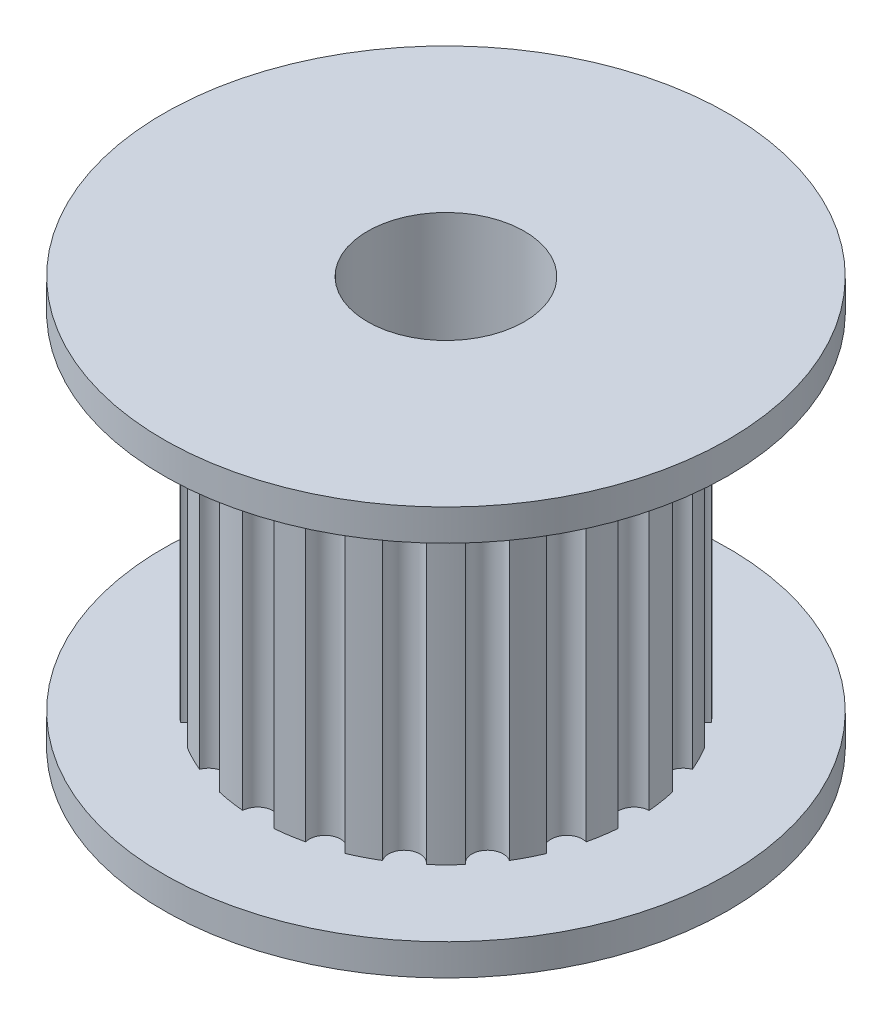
ISO-10303-21;
HEADER;
FILE_DESCRIPTION(('STEP AP214'),'2;1');
FILE_NAME('part.step','',(''),(''),'','','');
FILE_SCHEMA(('AUTOMOTIVE_DESIGN { 1 0 10303 214 1 1 1 1 }'));
ENDSEC;
DATA;
#1=APPLICATION_CONTEXT('core data for automotive mechanical design processes');
#2=APPLICATION_PROTOCOL_DEFINITION('international standard','automotive_design',2000,#1);
#3=PRODUCT_CONTEXT('',#1,'mechanical');
#4=PRODUCT('Part','Part','',(#3));
#5=PRODUCT_RELATED_PRODUCT_CATEGORY('part','',(#4));
#6=PRODUCT_DEFINITION_FORMATION('','',#4);
#7=PRODUCT_DEFINITION_CONTEXT('part definition',#1,'design');
#8=PRODUCT_DEFINITION('design','',#6,#7);
#9=PRODUCT_DEFINITION_SHAPE('','',#8);
#10=(LENGTH_UNIT() NAMED_UNIT(*) SI_UNIT(.MILLI.,.METRE.));
#11=(NAMED_UNIT(*) PLANE_ANGLE_UNIT() SI_UNIT($,.RADIAN.));
#12=(NAMED_UNIT(*) SI_UNIT($,.STERADIAN.) SOLID_ANGLE_UNIT());
#13=UNCERTAINTY_MEASURE_WITH_UNIT(LENGTH_MEASURE(1.E-05),#10,'distance_accuracy_value','');
#14=(GEOMETRIC_REPRESENTATION_CONTEXT(3) GLOBAL_UNCERTAINTY_ASSIGNED_CONTEXT((#13)) GLOBAL_UNIT_ASSIGNED_CONTEXT((#10,
#11,#12)) REPRESENTATION_CONTEXT('',''));
#15=CARTESIAN_POINT('',(0.,0.,0.));
#16=DIRECTION('',(0.,0.,1.));
#17=DIRECTION('',(1.,0.,0.));
#18=AXIS2_PLACEMENT_3D('',#15,#16,#17);
#19=CARTESIAN_POINT('',(0.,-6.5,0.));
#20=DIRECTION('',(0.,-1.,0.));
#21=DIRECTION('',(1.,0.,0.));
#22=AXIS2_PLACEMENT_3D('',#19,#20,#21);
#23=CYLINDRICAL_SURFACE('',#22,6.);
#24=CARTESIAN_POINT('',(0.,-5.5,0.));
#25=DIRECTION('',(0.,-1.,0.));
#26=DIRECTION('',(1.,0.,0.));
#27=AXIS2_PLACEMENT_3D('',#24,#25,#26);
#28=CIRCLE('',#27,6.);
#29=CARTESIAN_POINT('',(3.91862319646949,-5.5,-4.54361004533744));
#30=VERTEX_POINT('',#29);
#31=CARTESIAN_POINT('',(4.54361004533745,-5.5,-3.91862319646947));
#32=VERTEX_POINT('',#31);
#33=EDGE_CURVE('E1229',#30,#32,#28,.T.);
#34=ORIENTED_EDGE('',*,*,#33,.F.);
#35=DIRECTION('',(0.,-1.,0.));
#36=VECTOR('',#35,1.);
#37=CARTESIAN_POINT('',(3.91862319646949,6.6827502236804,-4.54361004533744));
#38=LINE('',#37,#36);
#39=CARTESIAN_POINT('',(3.91862319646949,5.5,-4.54361004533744));
#40=VERTEX_POINT('',#39);
#41=EDGE_CURVE('E669',#40,#30,#38,.T.);
#42=ORIENTED_EDGE('',*,*,#41,.F.);
#43=CARTESIAN_POINT('',(0.,5.5,0.));
#44=DIRECTION('',(0.,-1.,0.));
#45=DIRECTION('',(1.,0.,0.));
#46=AXIS2_PLACEMENT_3D('',#43,#44,#45);
#47=CIRCLE('',#46,6.);
#48=CARTESIAN_POINT('',(4.54361004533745,5.5,-3.91862319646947));
#49=VERTEX_POINT('',#48);
#50=EDGE_CURVE('E501',#40,#49,#47,.T.);
#51=ORIENTED_EDGE('',*,*,#50,.T.);
#52=DIRECTION('',(0.,-1.,0.));
#53=VECTOR('',#52,1.);
#54=CARTESIAN_POINT('',(4.54361004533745,6.6827502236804,-3.91862319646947));
#55=LINE('',#54,#53);
#56=EDGE_CURVE('E661',#49,#32,#55,.T.);
#57=ORIENTED_EDGE('',*,*,#56,.T.);
#58=EDGE_LOOP('',(#34,#42,#51,#57));
#59=FACE_BOUND('',#58,.T.);
#60=ADVANCED_FACE('F34',(#59),#23,.T.);
#61=CARTESIAN_POINT('',(2.32277940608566,5.5,-5.53215110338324));
#62=VERTEX_POINT('',#61);
#63=CARTESIAN_POINT('',(3.11030877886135,5.5,-5.13088484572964));
#64=VERTEX_POINT('',#63);
#65=EDGE_CURVE('E329',#62,#64,#47,.T.);
#66=ORIENTED_EDGE('',*,*,#65,.T.);
#67=DIRECTION('',(0.,-1.,0.));
#68=VECTOR('',#67,1.);
#69=CARTESIAN_POINT('',(3.11030877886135,6.6827502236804,-5.13088484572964));
#70=LINE('',#69,#68);
#71=CARTESIAN_POINT('',(3.11030877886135,-5.5,-5.13088484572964));
#72=VERTEX_POINT('',#71);
#73=EDGE_CURVE('E512',#64,#72,#70,.T.);
#74=ORIENTED_EDGE('',*,*,#73,.T.);
#75=CARTESIAN_POINT('',(2.32277940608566,-5.5,-5.53215110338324));
#76=VERTEX_POINT('',#75);
#77=EDGE_CURVE('E322',#76,#72,#28,.T.);
#78=ORIENTED_EDGE('',*,*,#77,.F.);
#79=DIRECTION('',(0.,-1.,0.));
#80=VECTOR('',#79,1.);
#81=CARTESIAN_POINT('',(2.32277940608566,6.6580169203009,-5.53215110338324));
#82=LINE('',#81,#80);
#83=EDGE_CURVE('E394',#62,#76,#82,.T.);
#84=ORIENTED_EDGE('',*,*,#83,.F.);
#85=EDGE_LOOP('',(#66,#74,#78,#84));
#86=FACE_BOUND('',#85,.T.);
#87=ADVANCED_FACE('F352',(#86),#23,.T.);
#88=CARTESIAN_POINT('',(5.13088484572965,-5.5,-3.11030877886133));
#89=VERTEX_POINT('',#88);
#90=CARTESIAN_POINT('',(5.53215110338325,-5.5,-2.32277940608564));
#91=VERTEX_POINT('',#90);
#92=EDGE_CURVE('E1226',#89,#91,#28,.T.);
#93=ORIENTED_EDGE('',*,*,#92,.F.);
#94=DIRECTION('',(0.,-1.,0.));
#95=VECTOR('',#94,1.);
#96=CARTESIAN_POINT('',(5.13088484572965,6.6827502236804,-3.11030877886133));
#97=LINE('',#96,#95);
#98=CARTESIAN_POINT('',(5.13088484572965,5.5,-3.11030877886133));
#99=VERTEX_POINT('',#98);
#100=EDGE_CURVE('E663',#99,#89,#97,.T.);
#101=ORIENTED_EDGE('',*,*,#100,.F.);
#102=CARTESIAN_POINT('',(5.53215110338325,5.5,-2.32277940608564));
#103=VERTEX_POINT('',#102);
#104=EDGE_CURVE('E495',#99,#103,#47,.T.);
#105=ORIENTED_EDGE('',*,*,#104,.T.);
#106=DIRECTION('',(0.,-1.,0.));
#107=VECTOR('',#106,1.);
#108=CARTESIAN_POINT('',(5.53215110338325,6.6580169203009,-2.32277940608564));
#109=LINE('',#108,#107);
#110=EDGE_CURVE('E651',#103,#91,#109,.T.);
#111=ORIENTED_EDGE('',*,*,#110,.T.);
#112=EDGE_LOOP('',(#93,#101,#105,#111));
#113=FACE_BOUND('',#112,.T.);
#114=ADVANCED_FACE('F358',(#113),#23,.T.);
#115=CARTESIAN_POINT('',(5.84089973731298,-5.5,-1.37254881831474));
#116=VERTEX_POINT('',#115);
#117=CARTESIAN_POINT('',(5.97916666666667,-5.5,-0.499565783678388));
#118=VERTEX_POINT('',#117);
#119=EDGE_CURVE('E1223',#116,#118,#28,.T.);
#120=ORIENTED_EDGE('',*,*,#119,.F.);
#121=DIRECTION('',(0.,-1.,0.));
#122=VECTOR('',#121,1.);
#123=CARTESIAN_POINT('',(5.84089973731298,6.6580169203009,-1.37254881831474));
#124=LINE('',#123,#122);
#125=CARTESIAN_POINT('',(5.84089973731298,5.5,-1.37254881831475));
#126=VERTEX_POINT('',#125);
#127=EDGE_CURVE('E653',#126,#116,#124,.T.);
#128=ORIENTED_EDGE('',*,*,#127,.F.);
#129=CARTESIAN_POINT('',(5.97916666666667,5.5,-0.499565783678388));
#130=VERTEX_POINT('',#129);
#131=EDGE_CURVE('E489',#126,#130,#47,.T.);
#132=ORIENTED_EDGE('',*,*,#131,.T.);
#133=DIRECTION('',(0.,-1.,0.));
#134=VECTOR('',#133,1.);
#135=CARTESIAN_POINT('',(5.97916666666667,6.61725730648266,-0.499565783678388));
#136=LINE('',#135,#134);
#137=EDGE_CURVE('E641',#130,#118,#136,.T.);
#138=ORIENTED_EDGE('',*,*,#137,.T.);
#139=EDGE_LOOP('',(#120,#128,#132,#138));
#140=FACE_BOUND('',#139,.T.);
#141=ADVANCED_FACE('F836',(#140),#23,.T.);
#142=CARTESIAN_POINT('',(5.97916666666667,-5.5,0.49956578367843));
#143=VERTEX_POINT('',#142);
#144=CARTESIAN_POINT('',(5.84089973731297,-5.5,1.37254881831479));
#145=VERTEX_POINT('',#144);
#146=EDGE_CURVE('E1220',#143,#145,#28,.T.);
#147=ORIENTED_EDGE('',*,*,#146,.F.);
#148=DIRECTION('',(0.,-1.,0.));
#149=VECTOR('',#148,1.);
#150=CARTESIAN_POINT('',(5.97916666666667,6.61725730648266,0.49956578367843));
#151=LINE('',#150,#149);
#152=CARTESIAN_POINT('',(5.97916666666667,5.5,0.49956578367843));
#153=VERTEX_POINT('',#152);
#154=EDGE_CURVE('E643',#153,#143,#151,.T.);
#155=ORIENTED_EDGE('',*,*,#154,.F.);
#156=CARTESIAN_POINT('',(5.84089973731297,5.5,1.37254881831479));
#157=VERTEX_POINT('',#156);
#158=EDGE_CURVE('E483',#153,#157,#47,.T.);
#159=ORIENTED_EDGE('',*,*,#158,.T.);
#160=DIRECTION('',(0.,-1.,0.));
#161=VECTOR('',#160,1.);
#162=CARTESIAN_POINT('',(5.84089973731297,6.6580169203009,1.37254881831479));
#163=LINE('',#162,#161);
#164=EDGE_CURVE('E631',#157,#145,#163,.T.);
#165=ORIENTED_EDGE('',*,*,#164,.T.);
#166=EDGE_LOOP('',(#147,#155,#159,#165));
#167=FACE_BOUND('',#166,.T.);
#168=ADVANCED_FACE('F844',(#167),#23,.T.);
#169=CARTESIAN_POINT('',(5.53215110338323,-5.5,2.32277940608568));
#170=VERTEX_POINT('',#169);
#171=CARTESIAN_POINT('',(5.13088484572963,-5.5,3.11030877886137));
#172=VERTEX_POINT('',#171);
#173=EDGE_CURVE('E1217',#170,#172,#28,.T.);
#174=ORIENTED_EDGE('',*,*,#173,.F.);
#175=DIRECTION('',(0.,-1.,0.));
#176=VECTOR('',#175,1.);
#177=CARTESIAN_POINT('',(5.53215110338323,6.6580169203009,2.32277940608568));
#178=LINE('',#177,#176);
#179=CARTESIAN_POINT('',(5.53215110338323,5.5,2.32277940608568));
#180=VERTEX_POINT('',#179);
#181=EDGE_CURVE('E633',#180,#170,#178,.T.);
#182=ORIENTED_EDGE('',*,*,#181,.F.);
#183=CARTESIAN_POINT('',(5.13088484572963,5.5,3.11030877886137));
#184=VERTEX_POINT('',#183);
#185=EDGE_CURVE('E477',#180,#184,#47,.T.);
#186=ORIENTED_EDGE('',*,*,#185,.T.);
#187=DIRECTION('',(0.,-1.,0.));
#188=VECTOR('',#187,1.);
#189=CARTESIAN_POINT('',(5.13088484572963,6.6827502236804,3.11030877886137));
#190=LINE('',#189,#188);
#191=EDGE_CURVE('E621',#184,#172,#190,.T.);
#192=ORIENTED_EDGE('',*,*,#191,.T.);
#193=EDGE_LOOP('',(#174,#182,#186,#192));
#194=FACE_BOUND('',#193,.T.);
#195=ADVANCED_FACE('F852',(#194),#23,.T.);
#196=CARTESIAN_POINT('',(4.54361004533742,-5.5,3.91862319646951));
#197=VERTEX_POINT('',#196);
#198=CARTESIAN_POINT('',(3.91862319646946,-5.5,4.54361004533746));
#199=VERTEX_POINT('',#198);
#200=EDGE_CURVE('E1214',#197,#199,#28,.T.);
#201=ORIENTED_EDGE('',*,*,#200,.F.);
#202=DIRECTION('',(0.,-1.,0.));
#203=VECTOR('',#202,1.);
#204=CARTESIAN_POINT('',(4.54361004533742,6.6827502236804,3.91862319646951));
#205=LINE('',#204,#203);
#206=CARTESIAN_POINT('',(4.54361004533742,5.5,3.91862319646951));
#207=VERTEX_POINT('',#206);
#208=EDGE_CURVE('E623',#207,#197,#205,.T.);
#209=ORIENTED_EDGE('',*,*,#208,.F.);
#210=CARTESIAN_POINT('',(3.91862319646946,5.5,4.54361004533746));
#211=VERTEX_POINT('',#210);
#212=EDGE_CURVE('E471',#207,#211,#47,.T.);
#213=ORIENTED_EDGE('',*,*,#212,.T.);
#214=DIRECTION('',(0.,-1.,0.));
#215=VECTOR('',#214,1.);
#216=CARTESIAN_POINT('',(3.91862319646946,6.6827502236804,4.54361004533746));
#217=LINE('',#216,#215);
#218=EDGE_CURVE('E611',#211,#199,#217,.T.);
#219=ORIENTED_EDGE('',*,*,#218,.T.);
#220=EDGE_LOOP('',(#201,#209,#213,#219));
#221=FACE_BOUND('',#220,.T.);
#222=ADVANCED_FACE('F860',(#221),#23,.T.);
#223=CARTESIAN_POINT('',(3.11030877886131,-5.5,5.13088484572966));
#224=VERTEX_POINT('',#223);
#225=CARTESIAN_POINT('',(2.32277940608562,-5.5,5.53215110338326));
#226=VERTEX_POINT('',#225);
#227=EDGE_CURVE('E1211',#224,#226,#28,.T.);
#228=ORIENTED_EDGE('',*,*,#227,.F.);
#229=DIRECTION('',(0.,-1.,0.));
#230=VECTOR('',#229,1.);
#231=CARTESIAN_POINT('',(3.11030877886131,6.6827502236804,5.13088484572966));
#232=LINE('',#231,#230);
#233=CARTESIAN_POINT('',(3.11030877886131,5.5,5.13088484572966));
#234=VERTEX_POINT('',#233);
#235=EDGE_CURVE('E613',#234,#224,#232,.T.);
#236=ORIENTED_EDGE('',*,*,#235,.F.);
#237=CARTESIAN_POINT('',(2.32277940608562,5.5,5.53215110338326));
#238=VERTEX_POINT('',#237);
#239=EDGE_CURVE('E465',#234,#238,#47,.T.);
#240=ORIENTED_EDGE('',*,*,#239,.T.);
#241=DIRECTION('',(0.,-1.,0.));
#242=VECTOR('',#241,1.);
#243=CARTESIAN_POINT('',(2.32277940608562,6.6580169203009,5.53215110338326));
#244=LINE('',#243,#242);
#245=EDGE_CURVE('E601',#238,#226,#244,.T.);
#246=ORIENTED_EDGE('',*,*,#245,.T.);
#247=EDGE_LOOP('',(#228,#236,#240,#246));
#248=FACE_BOUND('',#247,.T.);
#249=ADVANCED_FACE('F868',(#248),#23,.T.);
#250=CARTESIAN_POINT('',(1.37254881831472,-5.5,5.84089973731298));
#251=VERTEX_POINT('',#250);
#252=CARTESIAN_POINT('',(0.49956578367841,-5.5,5.97916666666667));
#253=VERTEX_POINT('',#252);
#254=EDGE_CURVE('E1208',#251,#253,#28,.T.);
#255=ORIENTED_EDGE('',*,*,#254,.F.);
#256=DIRECTION('',(0.,-1.,0.));
#257=VECTOR('',#256,1.);
#258=CARTESIAN_POINT('',(1.37254881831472,6.6580169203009,5.84089973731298));
#259=LINE('',#258,#257);
#260=CARTESIAN_POINT('',(1.37254881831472,5.5,5.84089973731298));
#261=VERTEX_POINT('',#260);
#262=EDGE_CURVE('E603',#261,#251,#259,.T.);
#263=ORIENTED_EDGE('',*,*,#262,.F.);
#264=CARTESIAN_POINT('',(0.499565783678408,5.5,5.97916666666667));
#265=VERTEX_POINT('',#264);
#266=EDGE_CURVE('E459',#261,#265,#47,.T.);
#267=ORIENTED_EDGE('',*,*,#266,.T.);
#268=DIRECTION('',(0.,-1.,0.));
#269=VECTOR('',#268,1.);
#270=CARTESIAN_POINT('',(0.499565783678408,6.61725730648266,5.97916666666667));
#271=LINE('',#270,#269);
#272=EDGE_CURVE('E591',#265,#253,#271,.T.);
#273=ORIENTED_EDGE('',*,*,#272,.T.);
#274=EDGE_LOOP('',(#255,#263,#267,#273));
#275=FACE_BOUND('',#274,.T.);
#276=ADVANCED_FACE('F876',(#275),#23,.T.);
#277=CARTESIAN_POINT('',(-0.499565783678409,-5.5,5.97916666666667));
#278=VERTEX_POINT('',#277);
#279=CARTESIAN_POINT('',(-1.37254881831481,-5.5,5.84089973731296));
#280=VERTEX_POINT('',#279);
#281=EDGE_CURVE('E1205',#278,#280,#28,.T.);
#282=ORIENTED_EDGE('',*,*,#281,.F.);
#283=DIRECTION('',(0.,-1.,0.));
#284=VECTOR('',#283,1.);
#285=CARTESIAN_POINT('',(-0.49956578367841,6.61725730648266,5.97916666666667));
#286=LINE('',#285,#284);
#287=CARTESIAN_POINT('',(-0.49956578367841,5.5,5.97916666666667));
#288=VERTEX_POINT('',#287);
#289=EDGE_CURVE('E593',#288,#278,#286,.T.);
#290=ORIENTED_EDGE('',*,*,#289,.F.);
#291=CARTESIAN_POINT('',(-1.37254881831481,5.5,5.84089973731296));
#292=VERTEX_POINT('',#291);
#293=EDGE_CURVE('E453',#288,#292,#47,.T.);
#294=ORIENTED_EDGE('',*,*,#293,.T.);
#295=DIRECTION('',(0.,-1.,0.));
#296=VECTOR('',#295,1.);
#297=CARTESIAN_POINT('',(-1.37254881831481,6.6580169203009,5.84089973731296));
#298=LINE('',#297,#296);
#299=EDGE_CURVE('E581',#292,#280,#298,.T.);
#300=ORIENTED_EDGE('',*,*,#299,.T.);
#301=EDGE_LOOP('',(#282,#290,#294,#300));
#302=FACE_BOUND('',#301,.T.);
#303=ADVANCED_FACE('F884',(#302),#23,.T.);
#304=CARTESIAN_POINT('',(-2.3227794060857,-5.5,5.53215110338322));
#305=VERTEX_POINT('',#304);
#306=CARTESIAN_POINT('',(-3.11030877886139,-5.5,5.13088484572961));
#307=VERTEX_POINT('',#306);
#308=EDGE_CURVE('E1202',#305,#307,#28,.T.);
#309=ORIENTED_EDGE('',*,*,#308,.F.);
#310=DIRECTION('',(0.,-1.,0.));
#311=VECTOR('',#310,1.);
#312=CARTESIAN_POINT('',(-2.3227794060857,6.6580169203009,5.53215110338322));
#313=LINE('',#312,#311);
#314=CARTESIAN_POINT('',(-2.3227794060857,5.5,5.53215110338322));
#315=VERTEX_POINT('',#314);
#316=EDGE_CURVE('E583',#315,#305,#313,.T.);
#317=ORIENTED_EDGE('',*,*,#316,.F.);
#318=CARTESIAN_POINT('',(-3.11030877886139,5.5,5.13088484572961));
#319=VERTEX_POINT('',#318);
#320=EDGE_CURVE('E447',#315,#319,#47,.T.);
#321=ORIENTED_EDGE('',*,*,#320,.T.);
#322=DIRECTION('',(0.,-1.,0.));
#323=VECTOR('',#322,1.);
#324=CARTESIAN_POINT('',(-3.11030877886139,6.6827502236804,5.13088484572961));
#325=LINE('',#324,#323);
#326=EDGE_CURVE('E571',#319,#307,#325,.T.);
#327=ORIENTED_EDGE('',*,*,#326,.T.);
#328=EDGE_LOOP('',(#309,#317,#321,#327));
#329=FACE_BOUND('',#328,.T.);
#330=ADVANCED_FACE('F892',(#329),#23,.T.);
#331=CARTESIAN_POINT('',(-3.91862319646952,-5.5,4.54361004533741));
#332=VERTEX_POINT('',#331);
#333=CARTESIAN_POINT('',(-4.54361004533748,-5.5,3.91862319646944));
#334=VERTEX_POINT('',#333);
#335=EDGE_CURVE('E1199',#332,#334,#28,.T.);
#336=ORIENTED_EDGE('',*,*,#335,.F.);
#337=DIRECTION('',(0.,-1.,0.));
#338=VECTOR('',#337,1.);
#339=CARTESIAN_POINT('',(-3.91862319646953,6.6827502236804,4.54361004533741));
#340=LINE('',#339,#338);
#341=CARTESIAN_POINT('',(-3.91862319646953,5.5,4.54361004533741));
#342=VERTEX_POINT('',#341);
#343=EDGE_CURVE('E573',#342,#332,#340,.T.);
#344=ORIENTED_EDGE('',*,*,#343,.F.);
#345=CARTESIAN_POINT('',(-4.54361004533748,5.5,3.91862319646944));
#346=VERTEX_POINT('',#345);
#347=EDGE_CURVE('E441',#342,#346,#47,.T.);
#348=ORIENTED_EDGE('',*,*,#347,.T.);
#349=DIRECTION('',(0.,-1.,0.));
#350=VECTOR('',#349,1.);
#351=CARTESIAN_POINT('',(-4.54361004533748,6.6827502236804,3.91862319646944));
#352=LINE('',#351,#350);
#353=EDGE_CURVE('E561',#346,#334,#352,.T.);
#354=ORIENTED_EDGE('',*,*,#353,.T.);
#355=EDGE_LOOP('',(#336,#344,#348,#354));
#356=FACE_BOUND('',#355,.T.);
#357=ADVANCED_FACE('F900',(#356),#23,.T.);
#358=CARTESIAN_POINT('',(-5.13088484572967,-5.5,3.11030877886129));
#359=VERTEX_POINT('',#358);
#360=CARTESIAN_POINT('',(-5.53215110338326,-5.5,2.3227794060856));
#361=VERTEX_POINT('',#360);
#362=EDGE_CURVE('E1196',#359,#361,#28,.T.);
#363=ORIENTED_EDGE('',*,*,#362,.F.);
#364=DIRECTION('',(0.,-1.,0.));
#365=VECTOR('',#364,1.);
#366=CARTESIAN_POINT('',(-5.13088484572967,6.6827502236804,3.11030877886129));
#367=LINE('',#366,#365);
#368=CARTESIAN_POINT('',(-5.13088484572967,5.5,3.11030877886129));
#369=VERTEX_POINT('',#368);
#370=EDGE_CURVE('E563',#369,#359,#367,.T.);
#371=ORIENTED_EDGE('',*,*,#370,.F.);
#372=CARTESIAN_POINT('',(-5.53215110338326,5.5,2.3227794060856));
#373=VERTEX_POINT('',#372);
#374=EDGE_CURVE('E435',#369,#373,#47,.T.);
#375=ORIENTED_EDGE('',*,*,#374,.T.);
#376=DIRECTION('',(0.,-1.,0.));
#377=VECTOR('',#376,1.);
#378=CARTESIAN_POINT('',(-5.53215110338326,6.6580169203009,2.3227794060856));
#379=LINE('',#378,#377);
#380=EDGE_CURVE('E551',#373,#361,#379,.T.);
#381=ORIENTED_EDGE('',*,*,#380,.T.);
#382=EDGE_LOOP('',(#363,#371,#375,#381));
#383=FACE_BOUND('',#382,.T.);
#384=ADVANCED_FACE('F908',(#383),#23,.T.);
#385=CARTESIAN_POINT('',(-5.84089973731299,-5.5,1.3725488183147));
#386=VERTEX_POINT('',#385);
#387=CARTESIAN_POINT('',(-5.97916666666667,-5.5,0.499565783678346));
#388=VERTEX_POINT('',#387);
#389=EDGE_CURVE('E1194',#386,#388,#28,.T.);
#390=ORIENTED_EDGE('',*,*,#389,.F.);
#391=DIRECTION('',(0.,-1.,0.));
#392=VECTOR('',#391,1.);
#393=CARTESIAN_POINT('',(-5.84089973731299,6.6580169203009,1.3725488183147));
#394=LINE('',#393,#392);
#395=CARTESIAN_POINT('',(-5.84089973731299,5.5,1.3725488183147));
#396=VERTEX_POINT('',#395);
#397=EDGE_CURVE('E553',#396,#386,#394,.T.);
#398=ORIENTED_EDGE('',*,*,#397,.F.);
#399=CARTESIAN_POINT('',(-5.97916666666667,5.5,0.499565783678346));
#400=VERTEX_POINT('',#399);
#401=EDGE_CURVE('E429',#396,#400,#47,.T.);
#402=ORIENTED_EDGE('',*,*,#401,.T.);
#403=DIRECTION('',(0.,-1.,0.));
#404=VECTOR('',#403,1.);
#405=CARTESIAN_POINT('',(-5.97916666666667,6.61725730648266,0.499565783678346));
#406=LINE('',#405,#404);
#407=EDGE_CURVE('E541',#400,#388,#406,.T.);
#408=ORIENTED_EDGE('',*,*,#407,.T.);
#409=EDGE_LOOP('',(#390,#398,#402,#408));
#410=FACE_BOUND('',#409,.T.);
#411=ADVANCED_FACE('F916',(#410),#23,.T.);
#412=CARTESIAN_POINT('',(-5.97916666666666,-5.5,-0.499565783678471));
#413=VERTEX_POINT('',#412);
#414=CARTESIAN_POINT('',(-5.84089973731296,-5.5,-1.37254881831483));
#415=VERTEX_POINT('',#414);
#416=EDGE_CURVE('E316',#413,#415,#28,.T.);
#417=ORIENTED_EDGE('',*,*,#416,.F.);
#418=DIRECTION('',(0.,-1.,0.));
#419=VECTOR('',#418,1.);
#420=CARTESIAN_POINT('',(-5.97916666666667,6.61725730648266,-0.499565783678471));
#421=LINE('',#420,#419);
#422=CARTESIAN_POINT('',(-5.97916666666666,5.5,-0.499565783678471));
#423=VERTEX_POINT('',#422);
#424=EDGE_CURVE('E543',#423,#413,#421,.T.);
#425=ORIENTED_EDGE('',*,*,#424,.F.);
#426=CARTESIAN_POINT('',(-5.84089973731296,5.5,-1.37254881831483));
#427=VERTEX_POINT('',#426);
#428=EDGE_CURVE('E423',#423,#427,#47,.T.);
#429=ORIENTED_EDGE('',*,*,#428,.T.);
#430=DIRECTION('',(0.,-1.,0.));
#431=VECTOR('',#430,1.);
#432=CARTESIAN_POINT('',(-5.84089973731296,6.6580169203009,-1.37254881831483));
#433=LINE('',#432,#431);
#434=EDGE_CURVE('E531',#427,#415,#433,.T.);
#435=ORIENTED_EDGE('',*,*,#434,.T.);
#436=EDGE_LOOP('',(#417,#425,#429,#435));
#437=FACE_BOUND('',#436,.T.);
#438=ADVANCED_FACE('F924',(#437),#23,.T.);
#439=CARTESIAN_POINT('',(-5.53215110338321,-5.5,-2.32277940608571));
#440=VERTEX_POINT('',#439);
#441=CARTESIAN_POINT('',(-5.1308848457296,-5.5,-3.1103087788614));
#442=VERTEX_POINT('',#441);
#443=EDGE_CURVE('E313',#440,#442,#28,.T.);
#444=ORIENTED_EDGE('',*,*,#443,.F.);
#445=DIRECTION('',(0.,-1.,0.));
#446=VECTOR('',#445,1.);
#447=CARTESIAN_POINT('',(-5.53215110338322,6.6580169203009,-2.32277940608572));
#448=LINE('',#447,#446);
#449=CARTESIAN_POINT('',(-5.53215110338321,5.5,-2.32277940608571));
#450=VERTEX_POINT('',#449);
#451=EDGE_CURVE('E533',#450,#440,#448,.T.);
#452=ORIENTED_EDGE('',*,*,#451,.F.);
#453=CARTESIAN_POINT('',(-5.13088484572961,5.5,-3.1103087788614));
#454=VERTEX_POINT('',#453);
#455=EDGE_CURVE('E421',#450,#454,#47,.T.);
#456=ORIENTED_EDGE('',*,*,#455,.T.);
#457=DIRECTION('',(0.,-1.,0.));
#458=VECTOR('',#457,1.);
#459=CARTESIAN_POINT('',(-5.13088484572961,6.6827502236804,-3.1103087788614));
#460=LINE('',#459,#458);
#461=EDGE_CURVE('E522',#454,#442,#460,.T.);
#462=ORIENTED_EDGE('',*,*,#461,.T.);
#463=EDGE_LOOP('',(#444,#452,#456,#462));
#464=FACE_BOUND('',#463,.T.);
#465=ADVANCED_FACE('F932',(#464),#23,.T.);
#466=CARTESIAN_POINT('',(-4.54361004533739,-5.5,-3.91862319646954));
#467=VERTEX_POINT('',#466);
#468=CARTESIAN_POINT('',(-3.91862319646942,-5.5,-4.54361004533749));
#469=VERTEX_POINT('',#468);
#470=EDGE_CURVE('E302',#467,#469,#28,.T.);
#471=ORIENTED_EDGE('',*,*,#470,.F.);
#472=DIRECTION('',(0.,-1.,0.));
#473=VECTOR('',#472,1.);
#474=CARTESIAN_POINT('',(-4.54361004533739,6.6827502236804,-3.91862319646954));
#475=LINE('',#474,#473);
#476=CARTESIAN_POINT('',(-4.54361004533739,5.5,-3.91862319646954));
#477=VERTEX_POINT('',#476);
#478=EDGE_CURVE('E524',#477,#467,#475,.T.);
#479=ORIENTED_EDGE('',*,*,#478,.F.);
#480=CARTESIAN_POINT('',(-3.91862319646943,5.5,-4.54361004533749));
#481=VERTEX_POINT('',#480);
#482=EDGE_CURVE('E304',#477,#481,#47,.T.);
#483=ORIENTED_EDGE('',*,*,#482,.T.);
#484=DIRECTION('',(0.,-1.,0.));
#485=VECTOR('',#484,1.);
#486=CARTESIAN_POINT('',(-3.91862319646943,6.6827502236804,-4.54361004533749));
#487=LINE('',#486,#485);
#488=EDGE_CURVE('E290',#481,#469,#487,.T.);
#489=ORIENTED_EDGE('',*,*,#488,.T.);
#490=EDGE_LOOP('',(#471,#479,#483,#489));
#491=FACE_BOUND('',#490,.T.);
#492=ADVANCED_FACE('F300',(#491),#23,.T.);
#493=CARTESIAN_POINT('',(-3.11030877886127,-5.5,-5.13088484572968));
#494=VERTEX_POINT('',#493);
#495=CARTESIAN_POINT('',(-2.32277940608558,-5.5,-5.53215110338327));
#496=VERTEX_POINT('',#495);
#497=EDGE_CURVE('E314',#494,#496,#28,.T.);
#498=ORIENTED_EDGE('',*,*,#497,.F.);
#499=DIRECTION('',(0.,-1.,0.));
#500=VECTOR('',#499,1.);
#501=CARTESIAN_POINT('',(-3.11030877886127,6.6827502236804,-5.13088484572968));
#502=LINE('',#501,#500);
#503=CARTESIAN_POINT('',(-3.11030877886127,5.5,-5.13088484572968));
#504=VERTEX_POINT('',#503);
#505=EDGE_CURVE('E293',#504,#494,#502,.T.);
#506=ORIENTED_EDGE('',*,*,#505,.F.);
#507=CARTESIAN_POINT('',(-2.32277940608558,5.5,-5.53215110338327));
#508=VERTEX_POINT('',#507);
#509=EDGE_CURVE('E416',#504,#508,#47,.T.);
#510=ORIENTED_EDGE('',*,*,#509,.T.);
#511=DIRECTION('',(0.,-1.,0.));
#512=VECTOR('',#511,1.);
#513=CARTESIAN_POINT('',(-2.32277940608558,6.6580169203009,-5.53215110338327));
#514=LINE('',#513,#512);
#515=EDGE_CURVE('E674',#508,#496,#514,.T.);
#516=ORIENTED_EDGE('',*,*,#515,.T.);
#517=EDGE_LOOP('',(#498,#506,#510,#516));
#518=FACE_BOUND('',#517,.T.);
#519=ADVANCED_FACE('F369',(#518),#23,.T.);
#520=CARTESIAN_POINT('',(-1.37254881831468,-5.5,-5.84089973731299));
#521=VERTEX_POINT('',#520);
#522=CARTESIAN_POINT('',(-0.499565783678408,-5.5,-5.97916666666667));
#523=VERTEX_POINT('',#522);
#524=EDGE_CURVE('E317',#521,#523,#28,.T.);
#525=ORIENTED_EDGE('',*,*,#524,.F.);
#526=DIRECTION('',(0.,-1.,0.));
#527=VECTOR('',#526,1.);
#528=CARTESIAN_POINT('',(-1.37254881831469,6.6580169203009,-5.84089973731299));
#529=LINE('',#528,#527);
#530=CARTESIAN_POINT('',(-1.37254881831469,5.5,-5.84089973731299));
#531=VERTEX_POINT('',#530);
#532=EDGE_CURVE('E414',#531,#521,#529,.T.);
#533=ORIENTED_EDGE('',*,*,#532,.F.);
#534=CARTESIAN_POINT('',(-0.49956578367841,5.5,-5.97916666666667));
#535=VERTEX_POINT('',#534);
#536=EDGE_CURVE('E321',#531,#535,#47,.T.);
#537=ORIENTED_EDGE('',*,*,#536,.T.);
#538=DIRECTION('',(0.,-1.,0.));
#539=VECTOR('',#538,1.);
#540=CARTESIAN_POINT('',(-0.49956578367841,6.61725730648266,-5.97916666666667));
#541=LINE('',#540,#539);
#542=EDGE_CURVE('E399',#535,#523,#541,.T.);
#543=ORIENTED_EDGE('',*,*,#542,.T.);
#544=EDGE_LOOP('',(#525,#533,#537,#543));
#545=FACE_BOUND('',#544,.T.);
#546=ADVANCED_FACE('F364',(#545),#23,.T.);
#547=CARTESIAN_POINT('',(0.499565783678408,5.5,-5.97916666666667));
#548=VERTEX_POINT('',#547);
#549=CARTESIAN_POINT('',(1.37254881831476,5.5,-5.84089973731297));
#550=VERTEX_POINT('',#549);
#551=EDGE_CURVE('E325',#548,#550,#47,.T.);
#552=ORIENTED_EDGE('',*,*,#551,.T.);
#553=DIRECTION('',(0.,-1.,0.));
#554=VECTOR('',#553,1.);
#555=CARTESIAN_POINT('',(1.37254881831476,6.6580169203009,-5.84089973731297));
#556=LINE('',#555,#554);
#557=CARTESIAN_POINT('',(1.37254881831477,-5.5,-5.84089973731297));
#558=VERTEX_POINT('',#557);
#559=EDGE_CURVE('E375',#550,#558,#556,.T.);
#560=ORIENTED_EDGE('',*,*,#559,.T.);
#561=CARTESIAN_POINT('',(0.499565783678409,-5.5,-5.97916666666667));
#562=VERTEX_POINT('',#561);
#563=EDGE_CURVE('E318',#562,#558,#28,.T.);
#564=ORIENTED_EDGE('',*,*,#563,.F.);
#565=DIRECTION('',(0.,-1.,0.));
#566=VECTOR('',#565,1.);
#567=CARTESIAN_POINT('',(0.499565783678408,6.61725730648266,-5.97916666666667));
#568=LINE('',#567,#566);
#569=EDGE_CURVE('E377',#548,#562,#568,.T.);
#570=ORIENTED_EDGE('',*,*,#569,.F.);
#571=EDGE_LOOP('',(#552,#560,#564,#570));
#572=FACE_BOUND('',#571,.T.);
#573=ADVANCED_FACE('F349',(#572),#23,.T.);
#574=CARTESIAN_POINT('',(9.,-6.5,0.));
#575=DIRECTION('',(0.,-1.,0.));
#576=DIRECTION('',(1.,0.,0.));
#577=AXIS2_PLACEMENT_3D('',#574,#575,#576);
#578=PLANE('',#577);
#579=CARTESIAN_POINT('',(0.,-6.5,0.));
#580=DIRECTION('',(0.,-1.,0.));
#581=DIRECTION('',(1.,0.,0.));
#582=AXIS2_PLACEMENT_3D('',#579,#580,#581);
#583=CIRCLE('',#582,9.);
#584=CARTESIAN_POINT('',(9.,-6.5,0.));
#585=VERTEX_POINT('',#584);
#586=EDGE_CURVE('E402',#585,#585,#583,.T.);
#587=ORIENTED_EDGE('',*,*,#586,.T.);
#588=EDGE_LOOP('',(#587));
#589=FACE_BOUND('',#588,.T.);
#590=CARTESIAN_POINT('',(0.,-6.5,0.));
#591=DIRECTION('',(0.,-1.,0.));
#592=DIRECTION('',(1.,0.,0.));
#593=AXIS2_PLACEMENT_3D('',#590,#591,#592);
#594=CIRCLE('',#593,2.5);
#595=CARTESIAN_POINT('',(2.5,-6.5,0.));
#596=VERTEX_POINT('',#595);
#597=EDGE_CURVE('E11',#596,#596,#594,.T.);
#598=ORIENTED_EDGE('',*,*,#597,.F.);
#599=EDGE_LOOP('',(#598));
#600=FACE_BOUND('',#599,.T.);
#601=ADVANCED_FACE('F36',(#589,#600),#578,.T.);
#602=CARTESIAN_POINT('',(0.,-6.5,0.));
#603=DIRECTION('',(0.,-1.,0.));
#604=DIRECTION('',(1.,0.,0.));
#605=AXIS2_PLACEMENT_3D('',#602,#603,#604);
#606=CYLINDRICAL_SURFACE('',#605,2.5);
#607=ORIENTED_EDGE('',*,*,#597,.T.);
#608=EDGE_LOOP('',(#607));
#609=FACE_BOUND('',#608,.T.);
#610=CARTESIAN_POINT('',(0.,6.5,0.));
#611=DIRECTION('',(0.,-1.,0.));
#612=DIRECTION('',(1.,0.,0.));
#613=AXIS2_PLACEMENT_3D('',#610,#611,#612);
#614=CIRCLE('',#613,2.5);
#615=CARTESIAN_POINT('',(2.5,6.5,0.));
#616=VERTEX_POINT('',#615);
#617=EDGE_CURVE('E42',#616,#616,#614,.T.);
#618=ORIENTED_EDGE('',*,*,#617,.F.);
#619=EDGE_LOOP('',(#618));
#620=FACE_BOUND('',#619,.T.);
#621=ADVANCED_FACE('F340',(#609,#620),#606,.F.);
#622=CARTESIAN_POINT('',(2.5,6.5,0.));
#623=DIRECTION('',(0.,1.,0.));
#624=DIRECTION('',(-1.,0.,0.));
#625=AXIS2_PLACEMENT_3D('',#622,#623,#624);
#626=PLANE('',#625);
#627=ORIENTED_EDGE('',*,*,#617,.T.);
#628=EDGE_LOOP('',(#627));
#629=FACE_BOUND('',#628,.T.);
#630=CARTESIAN_POINT('',(0.,6.5,0.));
#631=DIRECTION('',(0.,-1.,0.));
#632=DIRECTION('',(1.,0.,0.));
#633=AXIS2_PLACEMENT_3D('',#630,#631,#632);
#634=CIRCLE('',#633,9.);
#635=CARTESIAN_POINT('',(9.,6.5,0.));
#636=VERTEX_POINT('',#635);
#637=EDGE_CURVE('E332',#636,#636,#634,.T.);
#638=ORIENTED_EDGE('',*,*,#637,.F.);
#639=EDGE_LOOP('',(#638));
#640=FACE_BOUND('',#639,.T.);
#641=ADVANCED_FACE('F337',(#629,#640),#626,.T.);
#642=CARTESIAN_POINT('',(0.,-6.5,0.));
#643=DIRECTION('',(0.,-1.,0.));
#644=DIRECTION('',(1.,0.,0.));
#645=AXIS2_PLACEMENT_3D('',#642,#643,#644);
#646=CYLINDRICAL_SURFACE('',#645,9.);
#647=ORIENTED_EDGE('',*,*,#637,.T.);
#648=EDGE_LOOP('',(#647));
#649=FACE_BOUND('',#648,.T.);
#650=CARTESIAN_POINT('',(0.,5.5,0.));
#651=DIRECTION('',(0.,-1.,0.));
#652=DIRECTION('',(1.,0.,0.));
#653=AXIS2_PLACEMENT_3D('',#650,#651,#652);
#654=CIRCLE('',#653,9.);
#655=CARTESIAN_POINT('',(9.,5.5,0.));
#656=VERTEX_POINT('',#655);
#657=EDGE_CURVE('E328',#656,#656,#654,.T.);
#658=ORIENTED_EDGE('',*,*,#657,.F.);
#659=EDGE_LOOP('',(#658));
#660=FACE_BOUND('',#659,.T.);
#661=ADVANCED_FACE('F347',(#649,#660),#646,.T.);
#662=CARTESIAN_POINT('',(9.,5.5,0.));
#663=DIRECTION('',(0.,-1.,0.));
#664=DIRECTION('',(1.,0.,0.));
#665=AXIS2_PLACEMENT_3D('',#662,#663,#664);
#666=PLANE('',#665);
#667=ORIENTED_EDGE('',*,*,#657,.T.);
#668=EDGE_LOOP('',(#667));
#669=FACE_BOUND('',#668,.T.);
#670=ORIENTED_EDGE('',*,*,#551,.F.);
#671=CARTESIAN_POINT('',(0.,5.5,-6.));
#672=DIRECTION('',(0.,-1.,0.));
#673=DIRECTION('',(1.,0.,0.));
#674=AXIS2_PLACEMENT_3D('',#671,#672,#673);
#675=CIRCLE('',#674,0.500000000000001);
#676=EDGE_CURVE('E383',#548,#535,#675,.T.);
#677=ORIENTED_EDGE('',*,*,#676,.T.);
#678=ORIENTED_EDGE('',*,*,#536,.F.);
#679=CARTESIAN_POINT('',(-1.85410196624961,5.5,-5.70633909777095));
#680=DIRECTION('',(0.,-1.,0.));
#681=DIRECTION('',(1.,0.,0.));
#682=AXIS2_PLACEMENT_3D('',#679,#680,#681);
#683=CIRCLE('',#682,0.500000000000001);
#684=EDGE_CURVE('E295',#531,#508,#683,.T.);
#685=ORIENTED_EDGE('',*,*,#684,.T.);
#686=ORIENTED_EDGE('',*,*,#509,.F.);
#687=CARTESIAN_POINT('',(-3.52671151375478,5.5,-4.85410196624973));
#688=DIRECTION('',(0.,-1.,0.));
#689=DIRECTION('',(1.,0.,0.));
#690=AXIS2_PLACEMENT_3D('',#687,#688,#689);
#691=CIRCLE('',#690,0.500000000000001);
#692=EDGE_CURVE('E305',#504,#481,#691,.T.);
#693=ORIENTED_EDGE('',*,*,#692,.T.);
#694=ORIENTED_EDGE('',*,*,#482,.F.);
#695=CARTESIAN_POINT('',(-4.85410196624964,5.5,-3.5267115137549));
#696=DIRECTION('',(0.,-1.,0.));
#697=DIRECTION('',(1.,0.,0.));
#698=AXIS2_PLACEMENT_3D('',#695,#696,#697);
#699=CIRCLE('',#698,0.500000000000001);
#700=EDGE_CURVE('E518',#477,#454,#699,.T.);
#701=ORIENTED_EDGE('',*,*,#700,.T.);
#702=ORIENTED_EDGE('',*,*,#455,.F.);
#703=CARTESIAN_POINT('',(-5.7063390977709,5.5,-1.85410196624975));
#704=DIRECTION('',(0.,-1.,0.));
#705=DIRECTION('',(1.,0.,0.));
#706=AXIS2_PLACEMENT_3D('',#703,#704,#705);
#707=CIRCLE('',#706,0.500000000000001);
#708=EDGE_CURVE('E527',#450,#427,#707,.T.);
#709=ORIENTED_EDGE('',*,*,#708,.T.);
#710=ORIENTED_EDGE('',*,*,#428,.F.);
#711=CARTESIAN_POINT('',(-6.,5.5,0.));
#712=DIRECTION('',(0.,-1.,0.));
#713=DIRECTION('',(1.,0.,0.));
#714=AXIS2_PLACEMENT_3D('',#711,#712,#713);
#715=CIRCLE('',#714,0.500000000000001);
#716=EDGE_CURVE('E537',#423,#400,#715,.T.);
#717=ORIENTED_EDGE('',*,*,#716,.T.);
#718=ORIENTED_EDGE('',*,*,#401,.F.);
#719=CARTESIAN_POINT('',(-5.70633909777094,5.5,1.85410196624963));
#720=DIRECTION('',(0.,-1.,0.));
#721=DIRECTION('',(1.,0.,0.));
#722=AXIS2_PLACEMENT_3D('',#719,#720,#721);
#723=CIRCLE('',#722,0.500000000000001);
#724=EDGE_CURVE('E547',#396,#373,#723,.T.);
#725=ORIENTED_EDGE('',*,*,#724,.T.);
#726=ORIENTED_EDGE('',*,*,#374,.F.);
#727=CARTESIAN_POINT('',(-4.85410196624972,5.5,3.52671151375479));
#728=DIRECTION('',(0.,-1.,0.));
#729=DIRECTION('',(1.,0.,0.));
#730=AXIS2_PLACEMENT_3D('',#727,#728,#729);
#731=CIRCLE('',#730,0.500000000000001);
#732=EDGE_CURVE('E557',#369,#346,#731,.T.);
#733=ORIENTED_EDGE('',*,*,#732,.T.);
#734=ORIENTED_EDGE('',*,*,#347,.F.);
#735=CARTESIAN_POINT('',(-3.52671151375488,5.5,4.85410196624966));
#736=DIRECTION('',(0.,-1.,0.));
#737=DIRECTION('',(1.,0.,0.));
#738=AXIS2_PLACEMENT_3D('',#735,#736,#737);
#739=CIRCLE('',#738,0.500000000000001);
#740=EDGE_CURVE('E567',#342,#319,#739,.T.);
#741=ORIENTED_EDGE('',*,*,#740,.T.);
#742=ORIENTED_EDGE('',*,*,#320,.F.);
#743=CARTESIAN_POINT('',(-1.85410196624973,5.5,5.70633909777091));
#744=DIRECTION('',(0.,-1.,0.));
#745=DIRECTION('',(1.,0.,0.));
#746=AXIS2_PLACEMENT_3D('',#743,#744,#745);
#747=CIRCLE('',#746,0.500000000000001);
#748=EDGE_CURVE('E577',#315,#292,#747,.T.);
#749=ORIENTED_EDGE('',*,*,#748,.T.);
#750=ORIENTED_EDGE('',*,*,#293,.F.);
#751=CARTESIAN_POINT('',(0.,5.5,6.));
#752=DIRECTION('',(0.,-1.,0.));
#753=DIRECTION('',(1.,0.,0.));
#754=AXIS2_PLACEMENT_3D('',#751,#752,#753);
#755=CIRCLE('',#754,0.500000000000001);
#756=EDGE_CURVE('E587',#288,#265,#755,.T.);
#757=ORIENTED_EDGE('',*,*,#756,.T.);
#758=ORIENTED_EDGE('',*,*,#266,.F.);
#759=CARTESIAN_POINT('',(1.85410196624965,5.5,5.70633909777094));
#760=DIRECTION('',(0.,-1.,0.));
#761=DIRECTION('',(1.,0.,0.));
#762=AXIS2_PLACEMENT_3D('',#759,#760,#761);
#763=CIRCLE('',#762,0.500000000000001);
#764=EDGE_CURVE('E597',#261,#238,#763,.T.);
#765=ORIENTED_EDGE('',*,*,#764,.T.);
#766=ORIENTED_EDGE('',*,*,#239,.F.);
#767=CARTESIAN_POINT('',(3.52671151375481,5.5,4.85410196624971));
#768=DIRECTION('',(0.,-1.,0.));
#769=DIRECTION('',(1.,0.,0.));
#770=AXIS2_PLACEMENT_3D('',#767,#768,#769);
#771=CIRCLE('',#770,0.500000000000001);
#772=EDGE_CURVE('E607',#234,#211,#771,.T.);
#773=ORIENTED_EDGE('',*,*,#772,.T.);
#774=ORIENTED_EDGE('',*,*,#212,.F.);
#775=CARTESIAN_POINT('',(4.85410196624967,5.5,3.52671151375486));
#776=DIRECTION('',(0.,-1.,0.));
#777=DIRECTION('',(1.,0.,0.));
#778=AXIS2_PLACEMENT_3D('',#775,#776,#777);
#779=CIRCLE('',#778,0.500000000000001);
#780=EDGE_CURVE('E617',#207,#184,#779,.T.);
#781=ORIENTED_EDGE('',*,*,#780,.T.);
#782=ORIENTED_EDGE('',*,*,#185,.F.);
#783=CARTESIAN_POINT('',(5.70633909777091,5.5,1.85410196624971));
#784=DIRECTION('',(0.,-1.,0.));
#785=DIRECTION('',(1.,0.,0.));
#786=AXIS2_PLACEMENT_3D('',#783,#784,#785);
#787=CIRCLE('',#786,0.500000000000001);
#788=EDGE_CURVE('E627',#180,#157,#787,.T.);
#789=ORIENTED_EDGE('',*,*,#788,.T.);
#790=ORIENTED_EDGE('',*,*,#158,.F.);
#791=CARTESIAN_POINT('',(6.,5.5,0.));
#792=DIRECTION('',(0.,-1.,0.));
#793=DIRECTION('',(1.,0.,0.));
#794=AXIS2_PLACEMENT_3D('',#791,#792,#793);
#795=CIRCLE('',#794,0.500000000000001);
#796=EDGE_CURVE('E637',#153,#130,#795,.T.);
#797=ORIENTED_EDGE('',*,*,#796,.T.);
#798=ORIENTED_EDGE('',*,*,#131,.F.);
#799=CARTESIAN_POINT('',(5.70633909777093,5.5,-1.85410196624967));
#800=DIRECTION('',(0.,-1.,0.));
#801=DIRECTION('',(1.,0.,0.));
#802=AXIS2_PLACEMENT_3D('',#799,#800,#801);
#803=CIRCLE('',#802,0.500000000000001);
#804=EDGE_CURVE('E647',#126,#103,#803,.T.);
#805=ORIENTED_EDGE('',*,*,#804,.T.);
#806=ORIENTED_EDGE('',*,*,#104,.F.);
#807=CARTESIAN_POINT('',(4.85410196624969,5.5,-3.52671151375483));
#808=DIRECTION('',(0.,-1.,0.));
#809=DIRECTION('',(1.,0.,0.));
#810=AXIS2_PLACEMENT_3D('',#807,#808,#809);
#811=CIRCLE('',#810,0.500000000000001);
#812=EDGE_CURVE('E657',#99,#49,#811,.T.);
#813=ORIENTED_EDGE('',*,*,#812,.T.);
#814=ORIENTED_EDGE('',*,*,#50,.F.);
#815=CARTESIAN_POINT('',(3.52671151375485,5.5,-4.85410196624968));
#816=DIRECTION('',(0.,-1.,0.));
#817=DIRECTION('',(1.,0.,0.));
#818=AXIS2_PLACEMENT_3D('',#815,#816,#817);
#819=CIRCLE('',#818,0.500000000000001);
#820=EDGE_CURVE('E515',#40,#64,#819,.T.);
#821=ORIENTED_EDGE('',*,*,#820,.T.);
#822=ORIENTED_EDGE('',*,*,#65,.F.);
#823=CARTESIAN_POINT('',(1.85410196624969,5.5,-5.70633909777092));
#824=DIRECTION('',(0.,-1.,0.));
#825=DIRECTION('',(1.,0.,0.));
#826=AXIS2_PLACEMENT_3D('',#823,#824,#825);
#827=CIRCLE('',#826,0.500000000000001);
#828=EDGE_CURVE('E385',#62,#550,#827,.T.);
#829=ORIENTED_EDGE('',*,*,#828,.T.);
#830=EDGE_LOOP('',(#670,#677,#678,#685,#686,#693,#694,#701,#702,#709,#710,#717,#718,#725,#726,
#733,#734,#741,#742,#749,#750,#757,#758,#765,#766,#773,#774,#781,#782,#789,#790,#797,#798,#805,
#806,#813,#814,#821,#822,#829));
#831=FACE_BOUND('',#830,.T.);
#832=ADVANCED_FACE('F381',(#669,#831),#666,.T.);
#833=CARTESIAN_POINT('',(6.,-5.5,0.));
#834=DIRECTION('',(0.,1.,0.));
#835=DIRECTION('',(-1.,0.,0.));
#836=AXIS2_PLACEMENT_3D('',#833,#834,#835);
#837=PLANE('',#836);
#838=ORIENTED_EDGE('',*,*,#563,.T.);
#839=CARTESIAN_POINT('',(1.85410196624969,-5.5,-5.70633909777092));
#840=DIRECTION('',(0.,1.,0.));
#841=DIRECTION('',(-0.951056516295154,0.,-0.309016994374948));
#842=AXIS2_PLACEMENT_3D('',#839,#840,#841);
#843=CIRCLE('',#842,0.500000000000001);
#844=EDGE_CURVE('E514',#558,#76,#843,.T.);
#845=ORIENTED_EDGE('',*,*,#844,.T.);
#846=ORIENTED_EDGE('',*,*,#77,.T.);
#847=CARTESIAN_POINT('',(3.52671151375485,-5.5,-4.85410196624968));
#848=DIRECTION('',(0.,1.,0.));
#849=DIRECTION('',(-0.809016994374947,0.,-0.587785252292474));
#850=AXIS2_PLACEMENT_3D('',#847,#848,#849);
#851=CIRCLE('',#850,0.500000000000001);
#852=EDGE_CURVE('E660',#72,#30,#851,.T.);
#853=ORIENTED_EDGE('',*,*,#852,.T.);
#854=ORIENTED_EDGE('',*,*,#33,.T.);
#855=CARTESIAN_POINT('',(4.8541019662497,-5.5,-3.52671151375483));
#856=DIRECTION('',(0.,1.,0.));
#857=DIRECTION('',(-0.587785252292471,0.,-0.809016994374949));
#858=AXIS2_PLACEMENT_3D('',#855,#856,#857);
#859=CIRCLE('',#858,0.500000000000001);
#860=EDGE_CURVE('E650',#32,#89,#859,.T.);
#861=ORIENTED_EDGE('',*,*,#860,.T.);
#862=ORIENTED_EDGE('',*,*,#92,.T.);
#863=CARTESIAN_POINT('',(5.70633909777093,-5.5,-1.85410196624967));
#864=DIRECTION('',(0.,1.,0.));
#865=DIRECTION('',(-0.309016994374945,0.,-0.951056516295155));
#866=AXIS2_PLACEMENT_3D('',#863,#864,#865);
#867=CIRCLE('',#866,0.500000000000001);
#868=EDGE_CURVE('E640',#91,#116,#867,.T.);
#869=ORIENTED_EDGE('',*,*,#868,.T.);
#870=ORIENTED_EDGE('',*,*,#119,.T.);
#871=CARTESIAN_POINT('',(6.,-5.5,0.));
#872=DIRECTION('',(0.,1.,0.));
#873=DIRECTION('',(0.,0.,-1.));
#874=AXIS2_PLACEMENT_3D('',#871,#872,#873);
#875=CIRCLE('',#874,0.500000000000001);
#876=EDGE_CURVE('E630',#118,#143,#875,.T.);
#877=ORIENTED_EDGE('',*,*,#876,.T.);
#878=ORIENTED_EDGE('',*,*,#146,.T.);
#879=CARTESIAN_POINT('',(5.70633909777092,-5.5,1.85410196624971));
#880=DIRECTION('',(0.,1.,0.));
#881=DIRECTION('',(0.309016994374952,0.,-0.951056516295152));
#882=AXIS2_PLACEMENT_3D('',#879,#880,#881);
#883=CIRCLE('',#882,0.500000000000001);
#884=EDGE_CURVE('E620',#145,#170,#883,.T.);
#885=ORIENTED_EDGE('',*,*,#884,.T.);
#886=ORIENTED_EDGE('',*,*,#173,.T.);
#887=CARTESIAN_POINT('',(4.85410196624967,-5.5,3.52671151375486));
#888=DIRECTION('',(0.,1.,0.));
#889=DIRECTION('',(0.587785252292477,0.,-0.809016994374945));
#890=AXIS2_PLACEMENT_3D('',#887,#888,#889);
#891=CIRCLE('',#890,0.500000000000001);
#892=EDGE_CURVE('E610',#172,#197,#891,.T.);
#893=ORIENTED_EDGE('',*,*,#892,.T.);
#894=ORIENTED_EDGE('',*,*,#200,.T.);
#895=CARTESIAN_POINT('',(3.52671151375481,-5.5,4.85410196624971));
#896=DIRECTION('',(0.,1.,0.));
#897=DIRECTION('',(0.809016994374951,0.,-0.587785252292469));
#898=AXIS2_PLACEMENT_3D('',#895,#896,#897);
#899=CIRCLE('',#898,0.500000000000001);
#900=EDGE_CURVE('E600',#199,#224,#899,.T.);
#901=ORIENTED_EDGE('',*,*,#900,.T.);
#902=ORIENTED_EDGE('',*,*,#227,.T.);
#903=CARTESIAN_POINT('',(1.85410196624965,-5.5,5.70633909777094));
#904=DIRECTION('',(0.,1.,0.));
#905=DIRECTION('',(0.951056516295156,0.,-0.309016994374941));
#906=AXIS2_PLACEMENT_3D('',#903,#904,#905);
#907=CIRCLE('',#906,0.500000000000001);
#908=EDGE_CURVE('E590',#226,#251,#907,.T.);
#909=ORIENTED_EDGE('',*,*,#908,.T.);
#910=ORIENTED_EDGE('',*,*,#254,.T.);
#911=CARTESIAN_POINT('',(0.,-5.5,6.));
#912=DIRECTION('',(0.,1.,0.));
#913=DIRECTION('',(1.,0.,0.));
#914=AXIS2_PLACEMENT_3D('',#911,#912,#913);
#915=CIRCLE('',#914,0.500000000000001);
#916=EDGE_CURVE('E580',#253,#278,#915,.T.);
#917=ORIENTED_EDGE('',*,*,#916,.T.);
#918=ORIENTED_EDGE('',*,*,#281,.T.);
#919=CARTESIAN_POINT('',(-1.85410196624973,-5.5,5.70633909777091));
#920=DIRECTION('',(0.,1.,0.));
#921=DIRECTION('',(0.951056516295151,0.,0.309016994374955));
#922=AXIS2_PLACEMENT_3D('',#919,#920,#921);
#923=CIRCLE('',#922,0.500000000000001);
#924=EDGE_CURVE('E570',#280,#305,#923,.T.);
#925=ORIENTED_EDGE('',*,*,#924,.T.);
#926=ORIENTED_EDGE('',*,*,#308,.T.);
#927=CARTESIAN_POINT('',(-3.52671151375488,-5.5,4.85410196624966));
#928=DIRECTION('',(0.,1.,0.));
#929=DIRECTION('',(0.809016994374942,0.,0.58778525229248));
#930=AXIS2_PLACEMENT_3D('',#927,#928,#929);
#931=CIRCLE('',#930,0.500000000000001);
#932=EDGE_CURVE('E560',#307,#332,#931,.T.);
#933=ORIENTED_EDGE('',*,*,#932,.T.);
#934=ORIENTED_EDGE('',*,*,#335,.T.);
#935=CARTESIAN_POINT('',(-4.85410196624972,-5.5,3.52671151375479));
#936=DIRECTION('',(0.,1.,0.));
#937=DIRECTION('',(0.587785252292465,0.,0.809016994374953));
#938=AXIS2_PLACEMENT_3D('',#935,#936,#937);
#939=CIRCLE('',#938,0.500000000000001);
#940=EDGE_CURVE('E550',#334,#359,#939,.T.);
#941=ORIENTED_EDGE('',*,*,#940,.T.);
#942=ORIENTED_EDGE('',*,*,#362,.T.);
#943=CARTESIAN_POINT('',(-5.70633909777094,-5.5,1.85410196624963));
#944=DIRECTION('',(0.,1.,0.));
#945=DIRECTION('',(0.309016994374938,0.,0.951056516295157));
#946=AXIS2_PLACEMENT_3D('',#943,#944,#945);
#947=CIRCLE('',#946,0.500000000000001);
#948=EDGE_CURVE('E540',#361,#386,#947,.T.);
#949=ORIENTED_EDGE('',*,*,#948,.T.);
#950=ORIENTED_EDGE('',*,*,#389,.T.);
#951=CARTESIAN_POINT('',(-6.,-5.5,0.));
#952=DIRECTION('',(0.,1.,0.));
#953=DIRECTION('',(0.,0.,1.));
#954=AXIS2_PLACEMENT_3D('',#951,#952,#953);
#955=CIRCLE('',#954,0.500000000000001);
#956=EDGE_CURVE('E530',#388,#413,#955,.T.);
#957=ORIENTED_EDGE('',*,*,#956,.T.);
#958=ORIENTED_EDGE('',*,*,#416,.T.);
#959=CARTESIAN_POINT('',(-5.7063390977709,-5.5,-1.85410196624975));
#960=DIRECTION('',(0.,1.,0.));
#961=DIRECTION('',(-0.309016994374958,0.,0.95105651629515));
#962=AXIS2_PLACEMENT_3D('',#959,#960,#961);
#963=CIRCLE('',#962,0.500000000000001);
#964=EDGE_CURVE('E521',#415,#440,#963,.T.);
#965=ORIENTED_EDGE('',*,*,#964,.T.);
#966=ORIENTED_EDGE('',*,*,#443,.T.);
#967=CARTESIAN_POINT('',(-4.85410196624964,-5.5,-3.5267115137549));
#968=DIRECTION('',(0.,1.,0.));
#969=DIRECTION('',(-0.587785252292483,0.,0.80901699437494));
#970=AXIS2_PLACEMENT_3D('',#967,#968,#969);
#971=CIRCLE('',#970,0.500000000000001);
#972=EDGE_CURVE('E311',#442,#467,#971,.T.);
#973=ORIENTED_EDGE('',*,*,#972,.T.);
#974=ORIENTED_EDGE('',*,*,#470,.T.);
#975=CARTESIAN_POINT('',(-3.52671151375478,-5.5,-4.85410196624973));
#976=DIRECTION('',(0.,1.,0.));
#977=DIRECTION('',(-0.809016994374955,0.,0.587785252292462));
#978=AXIS2_PLACEMENT_3D('',#975,#976,#977);
#979=CIRCLE('',#978,0.500000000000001);
#980=EDGE_CURVE('E55',#469,#494,#979,.T.);
#981=ORIENTED_EDGE('',*,*,#980,.T.);
#982=ORIENTED_EDGE('',*,*,#497,.T.);
#983=CARTESIAN_POINT('',(-1.85410196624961,-5.5,-5.70633909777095));
#984=DIRECTION('',(0.,1.,0.));
#985=DIRECTION('',(-0.951056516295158,0.,0.309016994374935));
#986=AXIS2_PLACEMENT_3D('',#983,#984,#985);
#987=CIRCLE('',#986,0.500000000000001);
#988=EDGE_CURVE('E49',#496,#521,#987,.T.);
#989=ORIENTED_EDGE('',*,*,#988,.T.);
#990=ORIENTED_EDGE('',*,*,#524,.T.);
#991=CARTESIAN_POINT('',(0.,-5.5,-6.));
#992=DIRECTION('',(0.,1.,0.));
#993=DIRECTION('',(-1.,0.,0.));
#994=AXIS2_PLACEMENT_3D('',#991,#992,#993);
#995=CIRCLE('',#994,0.500000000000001);
#996=EDGE_CURVE('E391',#523,#562,#995,.T.);
#997=ORIENTED_EDGE('',*,*,#996,.T.);
#998=EDGE_LOOP('',(#838,#845,#846,#853,#854,#861,#862,#869,#870,#877,#878,#885,#886,#893,#894,
#901,#902,#909,#910,#917,#918,#925,#926,#933,#934,#941,#942,#949,#950,#957,#958,#965,#966,#973,
#974,#981,#982,#989,#990,#997));
#999=FACE_BOUND('',#998,.T.);
#1000=CARTESIAN_POINT('',(0.,-5.5,0.));
#1001=DIRECTION('',(0.,-1.,0.));
#1002=DIRECTION('',(1.,0.,0.));
#1003=AXIS2_PLACEMENT_3D('',#1000,#1001,#1002);
#1004=CIRCLE('',#1003,9.);
#1005=CARTESIAN_POINT('',(9.,-5.5,0.));
#1006=VERTEX_POINT('',#1005);
#1007=EDGE_CURVE('E323',#1006,#1006,#1004,.T.);
#1008=ORIENTED_EDGE('',*,*,#1007,.F.);
#1009=EDGE_LOOP('',(#1008));
#1010=FACE_BOUND('',#1009,.T.);
#1011=ADVANCED_FACE('F308',(#999,#1010),#837,.T.);
#1012=CARTESIAN_POINT('',(0.,-6.5,0.));
#1013=DIRECTION('',(0.,-1.,0.));
#1014=DIRECTION('',(1.,0.,0.));
#1015=AXIS2_PLACEMENT_3D('',#1012,#1013,#1014);
#1016=CYLINDRICAL_SURFACE('',#1015,9.);
#1017=ORIENTED_EDGE('',*,*,#1007,.T.);
#1018=EDGE_LOOP('',(#1017));
#1019=FACE_BOUND('',#1018,.T.);
#1020=ORIENTED_EDGE('',*,*,#586,.F.);
#1021=EDGE_LOOP('',(#1020));
#1022=FACE_BOUND('',#1021,.T.);
#1023=ADVANCED_FACE('F757',(#1019,#1022),#1016,.T.);
#1024=CARTESIAN_POINT('',(0.,6.61725730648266,-6.));
#1025=DIRECTION('',(0.,-1.,0.));
#1026=DIRECTION('',(1.,0.,0.));
#1027=AXIS2_PLACEMENT_3D('',#1024,#1025,#1026);
#1028=CYLINDRICAL_SURFACE('',#1027,0.500000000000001);
#1029=ORIENTED_EDGE('',*,*,#569,.T.);
#1030=ORIENTED_EDGE('',*,*,#996,.F.);
#1031=ORIENTED_EDGE('',*,*,#542,.F.);
#1032=ORIENTED_EDGE('',*,*,#676,.F.);
#1033=EDGE_LOOP('',(#1029,#1030,#1031,#1032));
#1034=FACE_BOUND('',#1033,.T.);
#1035=ADVANCED_FACE('F413',(#1034),#1028,.F.);
#1036=CARTESIAN_POINT('',(1.85410196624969,6.6580169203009,-5.70633909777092));
#1037=DIRECTION('',(0.,-1.,0.));
#1038=DIRECTION('',(1.,0.,0.));
#1039=AXIS2_PLACEMENT_3D('',#1036,#1037,#1038);
#1040=CYLINDRICAL_SURFACE('',#1039,0.500000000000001);
#1041=ORIENTED_EDGE('',*,*,#83,.T.);
#1042=ORIENTED_EDGE('',*,*,#844,.F.);
#1043=ORIENTED_EDGE('',*,*,#559,.F.);
#1044=ORIENTED_EDGE('',*,*,#828,.F.);
#1045=EDGE_LOOP('',(#1041,#1042,#1043,#1044));
#1046=FACE_BOUND('',#1045,.T.);
#1047=ADVANCED_FACE('F682',(#1046),#1040,.F.);
#1048=CARTESIAN_POINT('',(-1.85410196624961,6.6580169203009,-5.70633909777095));
#1049=DIRECTION('',(0.,-1.,0.));
#1050=DIRECTION('',(1.,0.,0.));
#1051=AXIS2_PLACEMENT_3D('',#1048,#1049,#1050);
#1052=CYLINDRICAL_SURFACE('',#1051,0.500000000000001);
#1053=ORIENTED_EDGE('',*,*,#532,.T.);
#1054=ORIENTED_EDGE('',*,*,#988,.F.);
#1055=ORIENTED_EDGE('',*,*,#515,.F.);
#1056=ORIENTED_EDGE('',*,*,#684,.F.);
#1057=EDGE_LOOP('',(#1053,#1054,#1055,#1056));
#1058=FACE_BOUND('',#1057,.T.);
#1059=ADVANCED_FACE('F680',(#1058),#1052,.F.);
#1060=CARTESIAN_POINT('',(-3.52671151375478,6.6827502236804,-4.85410196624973));
#1061=DIRECTION('',(0.,-1.,0.));
#1062=DIRECTION('',(1.,0.,0.));
#1063=AXIS2_PLACEMENT_3D('',#1060,#1061,#1062);
#1064=CYLINDRICAL_SURFACE('',#1063,0.500000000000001);
#1065=ORIENTED_EDGE('',*,*,#505,.T.);
#1066=ORIENTED_EDGE('',*,*,#980,.F.);
#1067=ORIENTED_EDGE('',*,*,#488,.F.);
#1068=ORIENTED_EDGE('',*,*,#692,.F.);
#1069=EDGE_LOOP('',(#1065,#1066,#1067,#1068));
#1070=FACE_BOUND('',#1069,.T.);
#1071=ADVANCED_FACE('F289',(#1070),#1064,.F.);
#1072=CARTESIAN_POINT('',(-4.85410196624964,6.6827502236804,-3.5267115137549));
#1073=DIRECTION('',(0.,-1.,0.));
#1074=DIRECTION('',(1.,0.,0.));
#1075=AXIS2_PLACEMENT_3D('',#1072,#1073,#1074);
#1076=CYLINDRICAL_SURFACE('',#1075,0.500000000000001);
#1077=ORIENTED_EDGE('',*,*,#478,.T.);
#1078=ORIENTED_EDGE('',*,*,#972,.F.);
#1079=ORIENTED_EDGE('',*,*,#461,.F.);
#1080=ORIENTED_EDGE('',*,*,#700,.F.);
#1081=EDGE_LOOP('',(#1077,#1078,#1079,#1080));
#1082=FACE_BOUND('',#1081,.T.);
#1083=ADVANCED_FACE('F688',(#1082),#1076,.F.);
#1084=CARTESIAN_POINT('',(-5.7063390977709,6.6580169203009,-1.85410196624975));
#1085=DIRECTION('',(0.,-1.,0.));
#1086=DIRECTION('',(1.,0.,0.));
#1087=AXIS2_PLACEMENT_3D('',#1084,#1085,#1086);
#1088=CYLINDRICAL_SURFACE('',#1087,0.500000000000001);
#1089=ORIENTED_EDGE('',*,*,#451,.T.);
#1090=ORIENTED_EDGE('',*,*,#964,.F.);
#1091=ORIENTED_EDGE('',*,*,#434,.F.);
#1092=ORIENTED_EDGE('',*,*,#708,.F.);
#1093=EDGE_LOOP('',(#1089,#1090,#1091,#1092));
#1094=FACE_BOUND('',#1093,.T.);
#1095=ADVANCED_FACE('F747',(#1094),#1088,.F.);
#1096=CARTESIAN_POINT('',(-6.,6.61725730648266,0.));
#1097=DIRECTION('',(0.,-1.,0.));
#1098=DIRECTION('',(1.,0.,0.));
#1099=AXIS2_PLACEMENT_3D('',#1096,#1097,#1098);
#1100=CYLINDRICAL_SURFACE('',#1099,0.500000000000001);
#1101=ORIENTED_EDGE('',*,*,#424,.T.);
#1102=ORIENTED_EDGE('',*,*,#956,.F.);
#1103=ORIENTED_EDGE('',*,*,#407,.F.);
#1104=ORIENTED_EDGE('',*,*,#716,.F.);
#1105=EDGE_LOOP('',(#1101,#1102,#1103,#1104));
#1106=FACE_BOUND('',#1105,.T.);
#1107=ADVANCED_FACE('F743',(#1106),#1100,.F.);
#1108=CARTESIAN_POINT('',(-5.70633909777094,6.6580169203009,1.85410196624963));
#1109=DIRECTION('',(0.,-1.,0.));
#1110=DIRECTION('',(1.,0.,0.));
#1111=AXIS2_PLACEMENT_3D('',#1108,#1109,#1110);
#1112=CYLINDRICAL_SURFACE('',#1111,0.500000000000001);
#1113=ORIENTED_EDGE('',*,*,#397,.T.);
#1114=ORIENTED_EDGE('',*,*,#948,.F.);
#1115=ORIENTED_EDGE('',*,*,#380,.F.);
#1116=ORIENTED_EDGE('',*,*,#724,.F.);
#1117=EDGE_LOOP('',(#1113,#1114,#1115,#1116));
#1118=FACE_BOUND('',#1117,.T.);
#1119=ADVANCED_FACE('F739',(#1118),#1112,.F.);
#1120=CARTESIAN_POINT('',(-4.85410196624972,6.6827502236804,3.52671151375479));
#1121=DIRECTION('',(0.,-1.,0.));
#1122=DIRECTION('',(1.,0.,0.));
#1123=AXIS2_PLACEMENT_3D('',#1120,#1121,#1122);
#1124=CYLINDRICAL_SURFACE('',#1123,0.500000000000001);
#1125=ORIENTED_EDGE('',*,*,#370,.T.);
#1126=ORIENTED_EDGE('',*,*,#940,.F.);
#1127=ORIENTED_EDGE('',*,*,#353,.F.);
#1128=ORIENTED_EDGE('',*,*,#732,.F.);
#1129=EDGE_LOOP('',(#1125,#1126,#1127,#1128));
#1130=FACE_BOUND('',#1129,.T.);
#1131=ADVANCED_FACE('F735',(#1130),#1124,.F.);
#1132=CARTESIAN_POINT('',(-3.52671151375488,6.6827502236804,4.85410196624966));
#1133=DIRECTION('',(0.,-1.,0.));
#1134=DIRECTION('',(1.,0.,0.));
#1135=AXIS2_PLACEMENT_3D('',#1132,#1133,#1134);
#1136=CYLINDRICAL_SURFACE('',#1135,0.500000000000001);
#1137=ORIENTED_EDGE('',*,*,#343,.T.);
#1138=ORIENTED_EDGE('',*,*,#932,.F.);
#1139=ORIENTED_EDGE('',*,*,#326,.F.);
#1140=ORIENTED_EDGE('',*,*,#740,.F.);
#1141=EDGE_LOOP('',(#1137,#1138,#1139,#1140));
#1142=FACE_BOUND('',#1141,.T.);
#1143=ADVANCED_FACE('F731',(#1142),#1136,.F.);
#1144=CARTESIAN_POINT('',(-1.85410196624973,6.6580169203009,5.70633909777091));
#1145=DIRECTION('',(0.,-1.,0.));
#1146=DIRECTION('',(1.,0.,0.));
#1147=AXIS2_PLACEMENT_3D('',#1144,#1145,#1146);
#1148=CYLINDRICAL_SURFACE('',#1147,0.500000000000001);
#1149=ORIENTED_EDGE('',*,*,#316,.T.);
#1150=ORIENTED_EDGE('',*,*,#924,.F.);
#1151=ORIENTED_EDGE('',*,*,#299,.F.);
#1152=ORIENTED_EDGE('',*,*,#748,.F.);
#1153=EDGE_LOOP('',(#1149,#1150,#1151,#1152));
#1154=FACE_BOUND('',#1153,.T.);
#1155=ADVANCED_FACE('F727',(#1154),#1148,.F.);
#1156=CARTESIAN_POINT('',(0.,6.61725730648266,6.));
#1157=DIRECTION('',(0.,-1.,0.));
#1158=DIRECTION('',(1.,0.,0.));
#1159=AXIS2_PLACEMENT_3D('',#1156,#1157,#1158);
#1160=CYLINDRICAL_SURFACE('',#1159,0.500000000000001);
#1161=ORIENTED_EDGE('',*,*,#289,.T.);
#1162=ORIENTED_EDGE('',*,*,#916,.F.);
#1163=ORIENTED_EDGE('',*,*,#272,.F.);
#1164=ORIENTED_EDGE('',*,*,#756,.F.);
#1165=EDGE_LOOP('',(#1161,#1162,#1163,#1164));
#1166=FACE_BOUND('',#1165,.T.);
#1167=ADVANCED_FACE('F723',(#1166),#1160,.F.);
#1168=CARTESIAN_POINT('',(1.85410196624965,6.6580169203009,5.70633909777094));
#1169=DIRECTION('',(0.,-1.,0.));
#1170=DIRECTION('',(1.,0.,0.));
#1171=AXIS2_PLACEMENT_3D('',#1168,#1169,#1170);
#1172=CYLINDRICAL_SURFACE('',#1171,0.500000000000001);
#1173=ORIENTED_EDGE('',*,*,#262,.T.);
#1174=ORIENTED_EDGE('',*,*,#908,.F.);
#1175=ORIENTED_EDGE('',*,*,#245,.F.);
#1176=ORIENTED_EDGE('',*,*,#764,.F.);
#1177=EDGE_LOOP('',(#1173,#1174,#1175,#1176));
#1178=FACE_BOUND('',#1177,.T.);
#1179=ADVANCED_FACE('F719',(#1178),#1172,.F.);
#1180=CARTESIAN_POINT('',(3.52671151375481,6.6827502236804,4.85410196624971));
#1181=DIRECTION('',(0.,-1.,0.));
#1182=DIRECTION('',(1.,0.,0.));
#1183=AXIS2_PLACEMENT_3D('',#1180,#1181,#1182);
#1184=CYLINDRICAL_SURFACE('',#1183,0.500000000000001);
#1185=ORIENTED_EDGE('',*,*,#235,.T.);
#1186=ORIENTED_EDGE('',*,*,#900,.F.);
#1187=ORIENTED_EDGE('',*,*,#218,.F.);
#1188=ORIENTED_EDGE('',*,*,#772,.F.);
#1189=EDGE_LOOP('',(#1185,#1186,#1187,#1188));
#1190=FACE_BOUND('',#1189,.T.);
#1191=ADVANCED_FACE('F715',(#1190),#1184,.F.);
#1192=CARTESIAN_POINT('',(4.85410196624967,6.6827502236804,3.52671151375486));
#1193=DIRECTION('',(0.,-1.,0.));
#1194=DIRECTION('',(1.,0.,0.));
#1195=AXIS2_PLACEMENT_3D('',#1192,#1193,#1194);
#1196=CYLINDRICAL_SURFACE('',#1195,0.500000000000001);
#1197=ORIENTED_EDGE('',*,*,#208,.T.);
#1198=ORIENTED_EDGE('',*,*,#892,.F.);
#1199=ORIENTED_EDGE('',*,*,#191,.F.);
#1200=ORIENTED_EDGE('',*,*,#780,.F.);
#1201=EDGE_LOOP('',(#1197,#1198,#1199,#1200));
#1202=FACE_BOUND('',#1201,.T.);
#1203=ADVANCED_FACE('F711',(#1202),#1196,.F.);
#1204=CARTESIAN_POINT('',(5.70633909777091,6.6580169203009,1.85410196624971));
#1205=DIRECTION('',(0.,-1.,0.));
#1206=DIRECTION('',(1.,0.,0.));
#1207=AXIS2_PLACEMENT_3D('',#1204,#1205,#1206);
#1208=CYLINDRICAL_SURFACE('',#1207,0.500000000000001);
#1209=ORIENTED_EDGE('',*,*,#181,.T.);
#1210=ORIENTED_EDGE('',*,*,#884,.F.);
#1211=ORIENTED_EDGE('',*,*,#164,.F.);
#1212=ORIENTED_EDGE('',*,*,#788,.F.);
#1213=EDGE_LOOP('',(#1209,#1210,#1211,#1212));
#1214=FACE_BOUND('',#1213,.T.);
#1215=ADVANCED_FACE('F707',(#1214),#1208,.F.);
#1216=CARTESIAN_POINT('',(6.,6.61725730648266,0.));
#1217=DIRECTION('',(0.,-1.,0.));
#1218=DIRECTION('',(1.,0.,0.));
#1219=AXIS2_PLACEMENT_3D('',#1216,#1217,#1218);
#1220=CYLINDRICAL_SURFACE('',#1219,0.500000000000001);
#1221=ORIENTED_EDGE('',*,*,#154,.T.);
#1222=ORIENTED_EDGE('',*,*,#876,.F.);
#1223=ORIENTED_EDGE('',*,*,#137,.F.);
#1224=ORIENTED_EDGE('',*,*,#796,.F.);
#1225=EDGE_LOOP('',(#1221,#1222,#1223,#1224));
#1226=FACE_BOUND('',#1225,.T.);
#1227=ADVANCED_FACE('F703',(#1226),#1220,.F.);
#1228=CARTESIAN_POINT('',(5.70633909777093,6.6580169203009,-1.85410196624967));
#1229=DIRECTION('',(0.,-1.,0.));
#1230=DIRECTION('',(1.,0.,0.));
#1231=AXIS2_PLACEMENT_3D('',#1228,#1229,#1230);
#1232=CYLINDRICAL_SURFACE('',#1231,0.500000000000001);
#1233=ORIENTED_EDGE('',*,*,#127,.T.);
#1234=ORIENTED_EDGE('',*,*,#868,.F.);
#1235=ORIENTED_EDGE('',*,*,#110,.F.);
#1236=ORIENTED_EDGE('',*,*,#804,.F.);
#1237=EDGE_LOOP('',(#1233,#1234,#1235,#1236));
#1238=FACE_BOUND('',#1237,.T.);
#1239=ADVANCED_FACE('F699',(#1238),#1232,.F.);
#1240=CARTESIAN_POINT('',(4.85410196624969,6.6827502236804,-3.52671151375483));
#1241=DIRECTION('',(0.,-1.,0.));
#1242=DIRECTION('',(1.,0.,0.));
#1243=AXIS2_PLACEMENT_3D('',#1240,#1241,#1242);
#1244=CYLINDRICAL_SURFACE('',#1243,0.500000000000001);
#1245=ORIENTED_EDGE('',*,*,#100,.T.);
#1246=ORIENTED_EDGE('',*,*,#860,.F.);
#1247=ORIENTED_EDGE('',*,*,#56,.F.);
#1248=ORIENTED_EDGE('',*,*,#812,.F.);
#1249=EDGE_LOOP('',(#1245,#1246,#1247,#1248));
#1250=FACE_BOUND('',#1249,.T.);
#1251=ADVANCED_FACE('F695',(#1250),#1244,.F.);
#1252=CARTESIAN_POINT('',(3.52671151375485,6.6827502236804,-4.85410196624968));
#1253=DIRECTION('',(0.,-1.,0.));
#1254=DIRECTION('',(1.,0.,0.));
#1255=AXIS2_PLACEMENT_3D('',#1252,#1253,#1254);
#1256=CYLINDRICAL_SURFACE('',#1255,0.500000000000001);
#1257=ORIENTED_EDGE('',*,*,#41,.T.);
#1258=ORIENTED_EDGE('',*,*,#852,.F.);
#1259=ORIENTED_EDGE('',*,*,#73,.F.);
#1260=ORIENTED_EDGE('',*,*,#820,.F.);
#1261=EDGE_LOOP('',(#1257,#1258,#1259,#1260));
#1262=FACE_BOUND('',#1261,.T.);
#1263=ADVANCED_FACE('F692',(#1262),#1256,.F.);
#1264=CLOSED_SHELL('',(#60,#87,#114,#141,#168,#195,#222,#249,#276,#303,#330,#357,#384,#411,#438,
#465,#492,#519,#546,#573,#601,#621,#641,#661,#832,#1011,#1023,#1035,#1047,#1059,#1071,#1083,
#1095,#1107,#1119,#1131,#1143,#1155,#1167,#1179,#1191,#1203,#1215,#1227,#1239,#1251,#1263));
#1265=MANIFOLD_SOLID_BREP('B2',#1264);
#1266=ADVANCED_BREP_SHAPE_REPRESENTATION('',(#18,#1265),#14);
#1267=SHAPE_DEFINITION_REPRESENTATION(#9,#1266);
ENDSEC;
END-ISO-10303-21;
